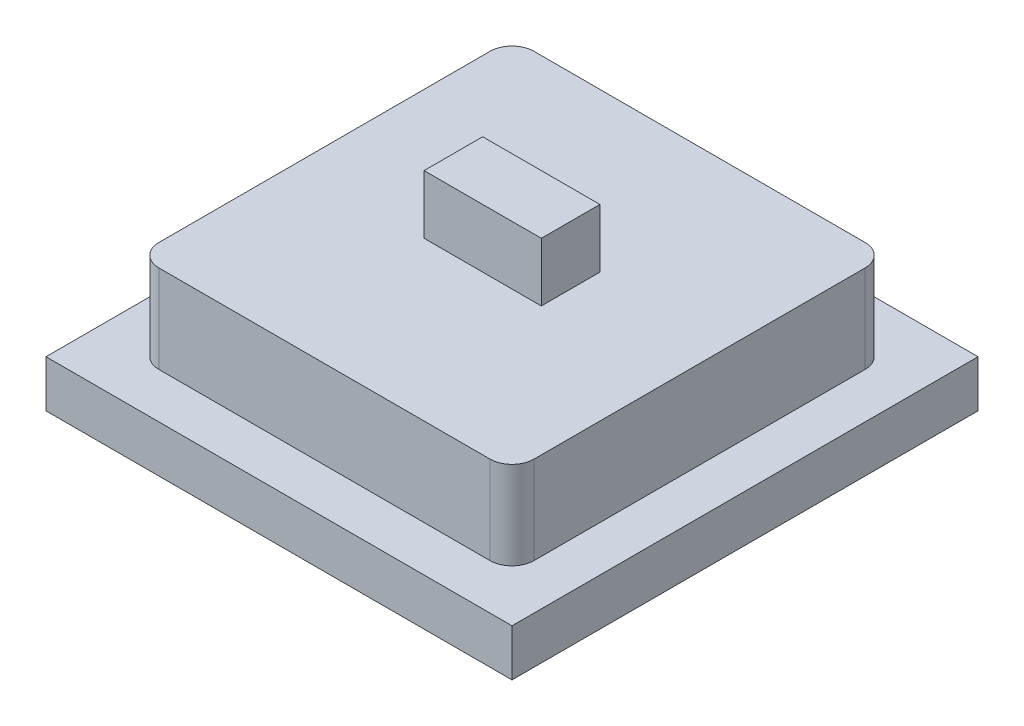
from build123d import *

# Parameters (mm, degrees)
BOSS_EXTRUDE1_DEPTH = 3
SKETCH2_W           = 15.9
SKETCH2_H           = 15.9
BOSS_EXTRUDE2_DEPTH = 1.6
SKETCH3_W           = 4
SKETCH3_H           = 2
BOSS_EXTRUDE3_DEPTH = 2


with BuildPart() as part:
    # Sketch1 → Boss-Extrude1 (new body)
    with BuildSketch(Plane(origin=(0, 0, 0), x_dir=(1, 0, 0), z_dir=(0, 1, 0))):
        with BuildLine():
            Line((-5.65, -6.4), (5.65, -6.4))
            ThreePointArc((5.65, -6.4), (6.180330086, -6.180330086), (6.4, -5.65))
            Line((6.4, -5.65), (6.4, 5.65))
            ThreePointArc((6.4, 5.65), (6.180330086, 6.180330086), (5.65, 6.4))
            Line((5.65, 6.4), (-5.65, 6.4))
            ThreePointArc((-5.65, 6.4), (-6.180330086, 6.180330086), (-6.4, 5.65))
            Line((-6.4, 5.65), (-6.4, -5.65))
            ThreePointArc((-6.4, -5.65), (-6.180330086, -6.180330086), (-5.65, -6.4))
        make_face()
    extrude(amount=BOSS_EXTRUDE1_DEPTH)

    # Sketch2 → Boss-Extrude2 (add)
    with BuildSketch(Plane.XZ):
        Rectangle(SKETCH2_W, SKETCH2_H)
    extrude(amount=BOSS_EXTRUDE2_DEPTH)

    # Sketch3 → Boss-Extrude3 (add)
    with BuildSketch(Plane(origin=(0, 3, 0), x_dir=(1, 0, 0), z_dir=(0, 1, 0))):
        Rectangle(SKETCH3_W, SKETCH3_H)
    extrude(amount=BOSS_EXTRUDE3_DEPTH)


solid = part.part
